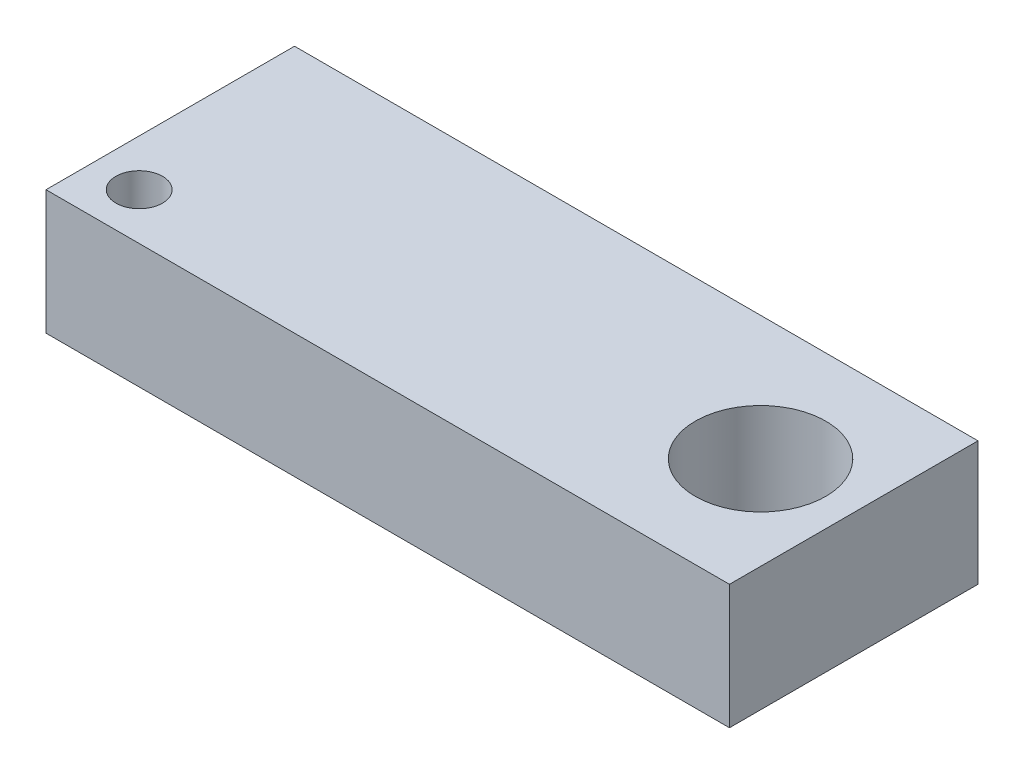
from build123d import *

# Parameters (mm, degrees)
ESQUISSE1_W             = 220
ESQUISSE1_H             = 40
BASE_EXTRUSION_DEPTH    = 80
ESQUISSE2_R             = 21
ENL_V_MAT_EXTRU_1_DEPTH = 238.486841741
ESQUISSE3_R             = 7.5
ENL_V_MAT_EXTRU_2_DEPTH = 238.486841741


with BuildPart() as part:
    # Esquisse1 → Base-Extrusion (new body)
    with BuildSketch(Plane.XY):
        with Locations((110, 20)):
            Rectangle(ESQUISSE1_W, ESQUISSE1_H)
    extrude(amount=BASE_EXTRUSION_DEPTH)

    # Esquisse2 → Enl_v. mat.-Extru.1 (cut, through all)
    with BuildSketch(Plane(origin=(0, 40, 0), x_dir=(-1, 0, 0), z_dir=(0, 1, 0))):
        with Locations(Location((-190, 40, 0), (0, 0, 90))):
            Circle(ESQUISSE2_R)
    extrude(amount=-ENL_V_MAT_EXTRU_1_DEPTH, mode=Mode.SUBTRACT)

    # Esquisse3 → Enl_v. mat.-Extru.2 (cut, through all)
    with BuildSketch(Plane(origin=(0, 40, 0), x_dir=(-1, 0, 0), z_dir=(0, 1, 0))):
        with Locations(Location((-15, 65, 0), (0, 0, 90))):
            Circle(ESQUISSE3_R)
    extrude(amount=-ENL_V_MAT_EXTRU_2_DEPTH, mode=Mode.SUBTRACT)


solid = part.part
